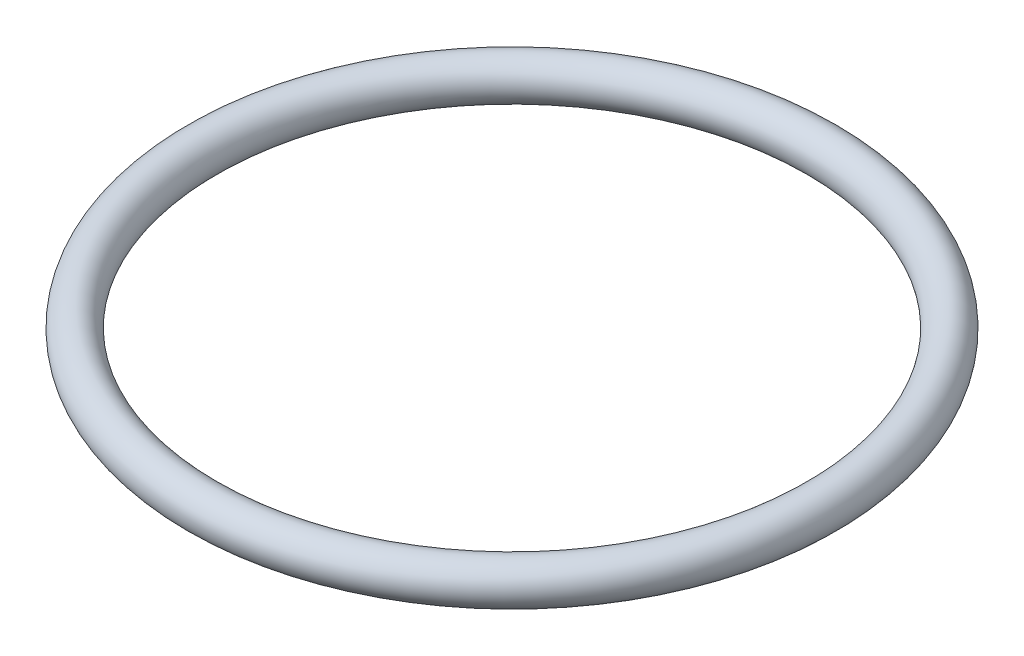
from build123d import *

# Parameters (mm, degrees)
SKETCH1_R = 0.508


with BuildPart() as part:
    # Sketch1 → Revolve1 (revolve)
    with BuildSketch(Plane.XY, mode=Mode.PRIVATE) as revolve1_sk:
        with Locations((7.747, 0)):
            Circle(SKETCH1_R)
    revolve(revolve1_sk.sketch.rotate(Axis((0, 0, 0), (0, 1, 0)), 90), axis=Axis((0, 0, 0), (0, 1, 0)))


solid = part.part
